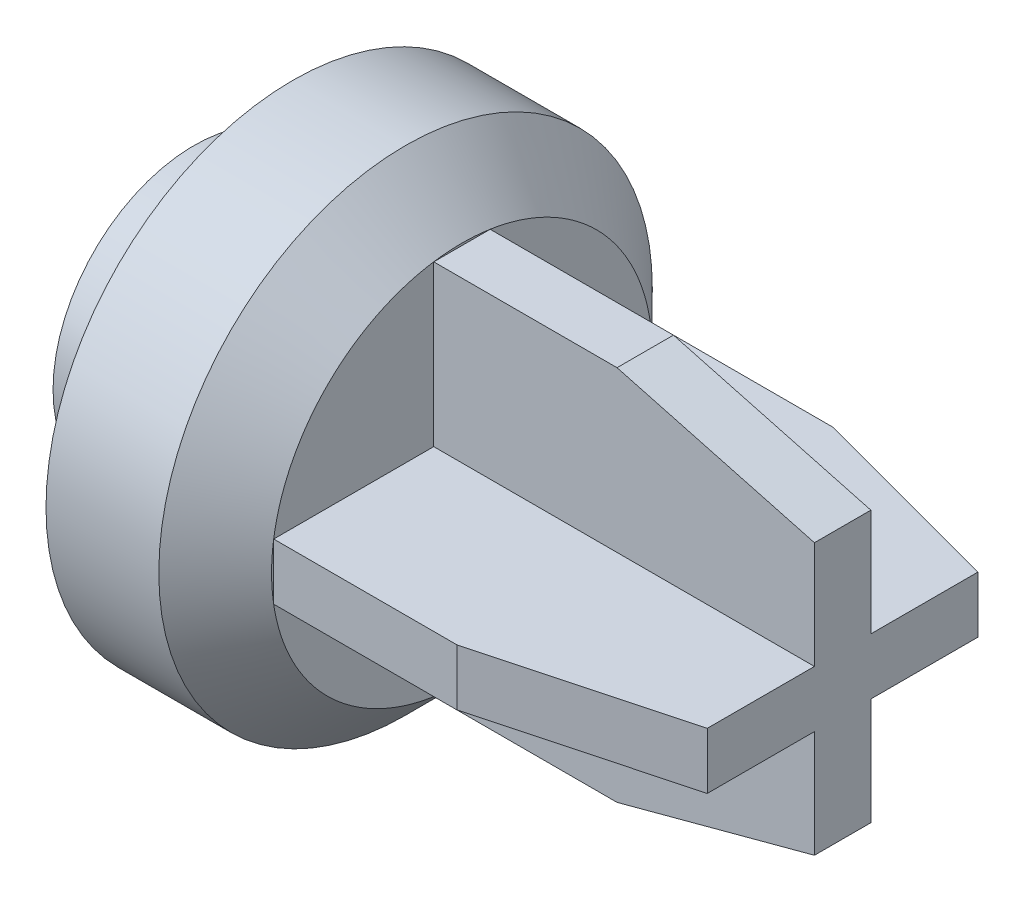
ISO-10303-21;
HEADER;
FILE_DESCRIPTION(('STEP AP214'),'2;1');
FILE_NAME('part.step','',(''),(''),'','','');
FILE_SCHEMA(('AUTOMOTIVE_DESIGN { 1 0 10303 214 1 1 1 1 }'));
ENDSEC;
DATA;
#1=APPLICATION_CONTEXT('core data for automotive mechanical design processes');
#2=APPLICATION_PROTOCOL_DEFINITION('international standard','automotive_design',2000,#1);
#3=PRODUCT_CONTEXT('',#1,'mechanical');
#4=PRODUCT('Part','Part','',(#3));
#5=PRODUCT_RELATED_PRODUCT_CATEGORY('part','',(#4));
#6=PRODUCT_DEFINITION_FORMATION('','',#4);
#7=PRODUCT_DEFINITION_CONTEXT('part definition',#1,'design');
#8=PRODUCT_DEFINITION('design','',#6,#7);
#9=PRODUCT_DEFINITION_SHAPE('','',#8);
#10=(LENGTH_UNIT() NAMED_UNIT(*) SI_UNIT(.MILLI.,.METRE.));
#11=(NAMED_UNIT(*) PLANE_ANGLE_UNIT() SI_UNIT($,.RADIAN.));
#12=(NAMED_UNIT(*) SI_UNIT($,.STERADIAN.) SOLID_ANGLE_UNIT());
#13=UNCERTAINTY_MEASURE_WITH_UNIT(LENGTH_MEASURE(1.E-05),#10,'distance_accuracy_value','');
#14=(GEOMETRIC_REPRESENTATION_CONTEXT(3) GLOBAL_UNCERTAINTY_ASSIGNED_CONTEXT((#13)) GLOBAL_UNIT_ASSIGNED_CONTEXT((#10,
#11,#12)) REPRESENTATION_CONTEXT('',''));
#15=CARTESIAN_POINT('',(0.,0.,0.));
#16=DIRECTION('',(0.,0.,1.));
#17=DIRECTION('',(1.,0.,0.));
#18=AXIS2_PLACEMENT_3D('',#15,#16,#17);
#19=CARTESIAN_POINT('',(2.5,-6.675,1.));
#20=DIRECTION('',(0.,0.,1.));
#21=DIRECTION('',(1.,0.,0.));
#22=AXIS2_PLACEMENT_3D('',#19,#20,#21);
#23=PLANE('',#22);
#24=DIRECTION('',(0.,1.,0.));
#25=VECTOR('',#24,1.);
#26=CARTESIAN_POINT('',(16.,4.8,1.));
#27=LINE('',#26,#25);
#28=CARTESIAN_POINT('',(16.,-4.8,1.));
#29=VERTEX_POINT('',#28);
#30=CARTESIAN_POINT('',(16.,-0.999999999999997,1.));
#31=VERTEX_POINT('',#30);
#32=EDGE_CURVE('E187',#29,#31,#27,.T.);
#33=ORIENTED_EDGE('',*,*,#32,.T.);
#34=DIRECTION('',(-1.,0.,0.));
#35=VECTOR('',#34,1.);
#36=CARTESIAN_POINT('',(2.5,-0.999999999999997,1.));
#37=LINE('',#36,#35);
#38=CARTESIAN_POINT('',(2.5,-0.999999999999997,1.));
#39=VERTEX_POINT('',#38);
#40=EDGE_CURVE('E169',#31,#39,#37,.T.);
#41=ORIENTED_EDGE('',*,*,#40,.T.);
#42=DIRECTION('',(0.,-1.,0.));
#43=VECTOR('',#42,1.);
#44=CARTESIAN_POINT('',(2.5,6.675,1.));
#45=LINE('',#44,#43);
#46=CARTESIAN_POINT('',(2.5,-6.675,1.));
#47=VERTEX_POINT('',#46);
#48=EDGE_CURVE('E182',#39,#47,#45,.T.);
#49=ORIENTED_EDGE('',*,*,#48,.T.);
#50=DIRECTION('',(1.,0.,0.));
#51=VECTOR('',#50,1.);
#52=CARTESIAN_POINT('',(2.5,-6.675,1.));
#53=LINE('',#52,#51);
#54=CARTESIAN_POINT('',(9.00000000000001,-6.675,1.));
#55=VERTEX_POINT('',#54);
#56=EDGE_CURVE('E181',#47,#55,#53,.T.);
#57=ORIENTED_EDGE('',*,*,#56,.T.);
#58=DIRECTION('',(0.965948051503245,0.258736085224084,0.));
#59=VECTOR('',#58,1.);
#60=CARTESIAN_POINT('',(16.,-4.8,1.));
#61=LINE('',#60,#59);
#62=EDGE_CURVE('E184',#55,#29,#61,.T.);
#63=ORIENTED_EDGE('',*,*,#62,.T.);
#64=EDGE_LOOP('',(#33,#41,#49,#57,#63));
#65=FACE_BOUND('',#64,.T.);
#66=ADVANCED_FACE('F32',(#65),#23,.T.);
#67=CARTESIAN_POINT('',(2.5,-6.675,-1.));
#68=DIRECTION('',(0.,0.,1.));
#69=DIRECTION('',(1.,0.,0.));
#70=AXIS2_PLACEMENT_3D('',#67,#68,#69);
#71=PLANE('',#70);
#72=DIRECTION('',(-1.,0.,0.));
#73=VECTOR('',#72,1.);
#74=CARTESIAN_POINT('',(2.5,-1.,-1.));
#75=LINE('',#74,#73);
#76=CARTESIAN_POINT('',(16.,-1.,-1.));
#77=VERTEX_POINT('',#76);
#78=CARTESIAN_POINT('',(2.5,-1.,-1.));
#79=VERTEX_POINT('',#78);
#80=EDGE_CURVE('E40',#77,#79,#75,.T.);
#81=ORIENTED_EDGE('',*,*,#80,.F.);
#82=DIRECTION('',(0.,1.,0.));
#83=VECTOR('',#82,1.);
#84=CARTESIAN_POINT('',(16.,4.8,-1.));
#85=LINE('',#84,#83);
#86=CARTESIAN_POINT('',(16.,-4.8,-1.));
#87=VERTEX_POINT('',#86);
#88=EDGE_CURVE('E203',#87,#77,#85,.T.);
#89=ORIENTED_EDGE('',*,*,#88,.F.);
#90=DIRECTION('',(0.965948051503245,0.258736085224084,0.));
#91=VECTOR('',#90,1.);
#92=CARTESIAN_POINT('',(16.,-4.8,-1.));
#93=LINE('',#92,#91);
#94=CARTESIAN_POINT('',(9.00000000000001,-6.675,-1.));
#95=VERTEX_POINT('',#94);
#96=EDGE_CURVE('E200',#95,#87,#93,.T.);
#97=ORIENTED_EDGE('',*,*,#96,.F.);
#98=DIRECTION('',(1.,0.,0.));
#99=VECTOR('',#98,1.);
#100=CARTESIAN_POINT('',(2.5,-6.675,-1.));
#101=LINE('',#100,#99);
#102=CARTESIAN_POINT('',(2.5,-6.675,-1.));
#103=VERTEX_POINT('',#102);
#104=EDGE_CURVE('E198',#103,#95,#101,.T.);
#105=ORIENTED_EDGE('',*,*,#104,.F.);
#106=DIRECTION('',(0.,-1.,0.));
#107=VECTOR('',#106,1.);
#108=CARTESIAN_POINT('',(2.5,6.675,-1.));
#109=LINE('',#108,#107);
#110=EDGE_CURVE('E178',#79,#103,#109,.T.);
#111=ORIENTED_EDGE('',*,*,#110,.F.);
#112=EDGE_LOOP('',(#81,#89,#97,#105,#111));
#113=FACE_BOUND('',#112,.T.);
#114=ADVANCED_FACE('F264',(#113),#71,.F.);
#115=CARTESIAN_POINT('',(0.,3.875,0.));
#116=DIRECTION('',(1.,0.,0.));
#117=DIRECTION('',(0.,0.,-1.));
#118=AXIS2_PLACEMENT_3D('',#115,#116,#117);
#119=PLANE('',#118);
#120=CARTESIAN_POINT('',(0.,0.,0.));
#121=DIRECTION('',(-1.,0.,0.));
#122=DIRECTION('',(0.,0.,1.));
#123=AXIS2_PLACEMENT_3D('',#120,#121,#122);
#124=CIRCLE('',#123,3.875);
#125=CARTESIAN_POINT('',(0.,0.,3.875));
#126=VERTEX_POINT('',#125);
#127=EDGE_CURVE('E251',#126,#126,#124,.T.);
#128=ORIENTED_EDGE('',*,*,#127,.T.);
#129=EDGE_LOOP('',(#128));
#130=FACE_BOUND('',#129,.T.);
#131=ADVANCED_FACE('F34',(#130),#119,.F.);
#132=CARTESIAN_POINT('',(-7.,0.,0.));
#133=DIRECTION('',(1.,0.,0.));
#134=DIRECTION('',(0.,0.,-1.));
#135=AXIS2_PLACEMENT_3D('',#132,#133,#134);
#136=CONICAL_SURFACE('',#135,3.5,0.0535202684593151);
#137=ORIENTED_EDGE('',*,*,#127,.F.);
#138=EDGE_LOOP('',(#137));
#139=FACE_BOUND('',#138,.T.);
#140=CARTESIAN_POINT('',(-7.,0.,0.));
#141=DIRECTION('',(-1.,0.,0.));
#142=DIRECTION('',(0.,0.,1.));
#143=AXIS2_PLACEMENT_3D('',#140,#141,#142);
#144=CIRCLE('',#143,3.5);
#145=CARTESIAN_POINT('',(-7.,0.,3.5));
#146=VERTEX_POINT('',#145);
#147=EDGE_CURVE('E248',#146,#146,#144,.T.);
#148=ORIENTED_EDGE('',*,*,#147,.T.);
#149=EDGE_LOOP('',(#148));
#150=FACE_BOUND('',#149,.T.);
#151=ADVANCED_FACE('F544',(#139,#150),#136,.F.);
#152=CARTESIAN_POINT('',(-7.,5.,0.));
#153=DIRECTION('',(1.,0.,0.));
#154=DIRECTION('',(0.,0.,-1.));
#155=AXIS2_PLACEMENT_3D('',#152,#153,#154);
#156=PLANE('',#155);
#157=ORIENTED_EDGE('',*,*,#147,.F.);
#158=EDGE_LOOP('',(#157));
#159=FACE_BOUND('',#158,.T.);
#160=CARTESIAN_POINT('',(-7.,0.,0.));
#161=DIRECTION('',(-1.,0.,0.));
#162=DIRECTION('',(0.,0.,1.));
#163=AXIS2_PLACEMENT_3D('',#160,#161,#162);
#164=CIRCLE('',#163,5.);
#165=CARTESIAN_POINT('',(-7.,0.,5.));
#166=VERTEX_POINT('',#165);
#167=EDGE_CURVE('E245',#166,#166,#164,.T.);
#168=ORIENTED_EDGE('',*,*,#167,.T.);
#169=EDGE_LOOP('',(#168));
#170=FACE_BOUND('',#169,.T.);
#171=ADVANCED_FACE('F534',(#159,#170),#156,.F.);
#172=CARTESIAN_POINT('',(-0.5,0.,0.));
#173=DIRECTION('',(1.,0.,0.));
#174=DIRECTION('',(0.,0.,-1.));
#175=AXIS2_PLACEMENT_3D('',#172,#173,#174);
#176=CONICAL_SURFACE('',#175,5.34,0.0522600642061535);
#177=ORIENTED_EDGE('',*,*,#167,.F.);
#178=EDGE_LOOP('',(#177));
#179=FACE_BOUND('',#178,.T.);
#180=CARTESIAN_POINT('',(-0.5,0.,0.));
#181=DIRECTION('',(-1.,0.,0.));
#182=DIRECTION('',(0.,0.,1.));
#183=AXIS2_PLACEMENT_3D('',#180,#181,#182);
#184=CIRCLE('',#183,5.34);
#185=CARTESIAN_POINT('',(-0.5,0.,5.34));
#186=VERTEX_POINT('',#185);
#187=EDGE_CURVE('E242',#186,#186,#184,.T.);
#188=ORIENTED_EDGE('',*,*,#187,.T.);
#189=EDGE_LOOP('',(#188));
#190=FACE_BOUND('',#189,.T.);
#191=ADVANCED_FACE('F524',(#179,#190),#176,.T.);
#192=CARTESIAN_POINT('',(-0.5,6.75,0.));
#193=DIRECTION('',(1.,0.,0.));
#194=DIRECTION('',(0.,0.,-1.));
#195=AXIS2_PLACEMENT_3D('',#192,#193,#194);
#196=PLANE('',#195);
#197=ORIENTED_EDGE('',*,*,#187,.F.);
#198=EDGE_LOOP('',(#197));
#199=FACE_BOUND('',#198,.T.);
#200=CARTESIAN_POINT('',(-0.5,0.,0.));
#201=DIRECTION('',(-1.,0.,0.));
#202=DIRECTION('',(0.,0.,1.));
#203=AXIS2_PLACEMENT_3D('',#200,#201,#202);
#204=CIRCLE('',#203,6.75);
#205=CARTESIAN_POINT('',(-0.5,0.,6.75));
#206=VERTEX_POINT('',#205);
#207=EDGE_CURVE('E239',#206,#206,#204,.T.);
#208=ORIENTED_EDGE('',*,*,#207,.T.);
#209=EDGE_LOOP('',(#208));
#210=FACE_BOUND('',#209,.T.);
#211=ADVANCED_FACE('F514',(#199,#210),#196,.F.);
#212=CARTESIAN_POINT('',(0.,0.,0.));
#213=DIRECTION('',(-1.,0.,0.));
#214=DIRECTION('',(0.,0.,1.));
#215=AXIS2_PLACEMENT_3D('',#212,#213,#214);
#216=CYLINDRICAL_SURFACE('',#215,6.75);
#217=ORIENTED_EDGE('',*,*,#207,.F.);
#218=EDGE_LOOP('',(#217));
#219=FACE_BOUND('',#218,.T.);
#220=CARTESIAN_POINT('',(-3.5,0.,0.));
#221=DIRECTION('',(-1.,0.,0.));
#222=DIRECTION('',(0.,0.,1.));
#223=AXIS2_PLACEMENT_3D('',#220,#221,#222);
#224=CIRCLE('',#223,6.75);
#225=CARTESIAN_POINT('',(-3.5,0.,6.75));
#226=VERTEX_POINT('',#225);
#227=EDGE_CURVE('E236',#226,#226,#224,.T.);
#228=ORIENTED_EDGE('',*,*,#227,.T.);
#229=EDGE_LOOP('',(#228));
#230=FACE_BOUND('',#229,.T.);
#231=ADVANCED_FACE('F504',(#219,#230),#216,.F.);
#232=CARTESIAN_POINT('',(-3.5,8.75,0.));
#233=DIRECTION('',(1.,0.,0.));
#234=DIRECTION('',(0.,0.,-1.));
#235=AXIS2_PLACEMENT_3D('',#232,#233,#234);
#236=PLANE('',#235);
#237=ORIENTED_EDGE('',*,*,#227,.F.);
#238=EDGE_LOOP('',(#237));
#239=FACE_BOUND('',#238,.T.);
#240=CARTESIAN_POINT('',(-3.5,0.,0.));
#241=DIRECTION('',(-1.,0.,0.));
#242=DIRECTION('',(0.,0.,1.));
#243=AXIS2_PLACEMENT_3D('',#240,#241,#242);
#244=CIRCLE('',#243,8.75);
#245=CARTESIAN_POINT('',(-3.5,0.,8.75));
#246=VERTEX_POINT('',#245);
#247=EDGE_CURVE('E233',#246,#246,#244,.T.);
#248=ORIENTED_EDGE('',*,*,#247,.T.);
#249=EDGE_LOOP('',(#248));
#250=FACE_BOUND('',#249,.T.);
#251=ADVANCED_FACE('F494',(#239,#250),#236,.F.);
#252=CARTESIAN_POINT('',(0.,0.,0.));
#253=DIRECTION('',(-1.,0.,0.));
#254=DIRECTION('',(0.,0.,1.));
#255=AXIS2_PLACEMENT_3D('',#252,#253,#254);
#256=CYLINDRICAL_SURFACE('',#255,8.75);
#257=ORIENTED_EDGE('',*,*,#247,.F.);
#258=EDGE_LOOP('',(#257));
#259=FACE_BOUND('',#258,.T.);
#260=CARTESIAN_POINT('',(0.5,0.,0.));
#261=DIRECTION('',(-1.,0.,0.));
#262=DIRECTION('',(0.,0.,1.));
#263=AXIS2_PLACEMENT_3D('',#260,#261,#262);
#264=CIRCLE('',#263,8.75);
#265=CARTESIAN_POINT('',(0.5,0.,8.75));
#266=VERTEX_POINT('',#265);
#267=EDGE_CURVE('E230',#266,#266,#264,.T.);
#268=ORIENTED_EDGE('',*,*,#267,.T.);
#269=EDGE_LOOP('',(#268));
#270=FACE_BOUND('',#269,.T.);
#271=ADVANCED_FACE('F484',(#259,#270),#256,.T.);
#272=CARTESIAN_POINT('',(2.5,0.,0.));
#273=DIRECTION('',(-1.,0.,0.));
#274=DIRECTION('',(0.,0.,1.));
#275=AXIS2_PLACEMENT_3D('',#272,#273,#274);
#276=CONICAL_SURFACE('',#275,6.74999999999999,0.78539816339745);
#277=ORIENTED_EDGE('',*,*,#267,.F.);
#278=EDGE_LOOP('',(#277));
#279=FACE_BOUND('',#278,.T.);
#280=CARTESIAN_POINT('',(2.5,0.,0.));
#281=DIRECTION('',(-1.,0.,0.));
#282=DIRECTION('',(0.,0.,1.));
#283=AXIS2_PLACEMENT_3D('',#280,#281,#282);
#284=CIRCLE('',#283,6.74999999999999);
#285=CARTESIAN_POINT('',(2.5,0.,6.74999999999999));
#286=VERTEX_POINT('',#285);
#287=EDGE_CURVE('E227',#286,#286,#284,.T.);
#288=ORIENTED_EDGE('',*,*,#287,.T.);
#289=EDGE_LOOP('',(#288));
#290=FACE_BOUND('',#289,.T.);
#291=ADVANCED_FACE('F479',(#279,#290),#276,.T.);
#292=CARTESIAN_POINT('',(2.5,6.74999999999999,0.));
#293=DIRECTION('',(-1.,0.,0.));
#294=DIRECTION('',(0.,0.,1.));
#295=AXIS2_PLACEMENT_3D('',#292,#293,#294);
#296=PLANE('',#295);
#297=DIRECTION('',(0.,-1.,0.));
#298=VECTOR('',#297,1.);
#299=CARTESIAN_POINT('',(2.5,1.00000000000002,6.675));
#300=LINE('',#299,#298);
#301=CARTESIAN_POINT('',(2.5,1.00000000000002,6.675));
#302=VERTEX_POINT('',#301);
#303=CARTESIAN_POINT('',(2.5,-0.999999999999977,6.675));
#304=VERTEX_POINT('',#303);
#305=EDGE_CURVE('E158',#302,#304,#300,.T.);
#306=ORIENTED_EDGE('',*,*,#305,.F.);
#307=DIRECTION('',(0.,0.,1.));
#308=VECTOR('',#307,1.);
#309=CARTESIAN_POINT('',(2.5,0.999999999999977,-6.675));
#310=LINE('',#309,#308);
#311=CARTESIAN_POINT('',(2.5,1.,1.));
#312=VERTEX_POINT('',#311);
#313=EDGE_CURVE('E144',#312,#302,#310,.T.);
#314=ORIENTED_EDGE('',*,*,#313,.F.);
#315=CARTESIAN_POINT('',(2.5,6.675,1.));
#316=VERTEX_POINT('',#315);
#317=EDGE_CURVE('E179',#316,#312,#45,.T.);
#318=ORIENTED_EDGE('',*,*,#317,.F.);
#319=DIRECTION('',(0.,0.,-1.));
#320=VECTOR('',#319,1.);
#321=CARTESIAN_POINT('',(2.5,6.675,1.));
#322=LINE('',#321,#320);
#323=CARTESIAN_POINT('',(2.5,6.675,-1.));
#324=VERTEX_POINT('',#323);
#325=EDGE_CURVE('E195',#316,#324,#322,.T.);
#326=ORIENTED_EDGE('',*,*,#325,.T.);
#327=CARTESIAN_POINT('',(2.5,0.999999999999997,-1.));
#328=VERTEX_POINT('',#327);
#329=EDGE_CURVE('E196',#324,#328,#109,.T.);
#330=ORIENTED_EDGE('',*,*,#329,.T.);
#331=CARTESIAN_POINT('',(2.5,0.999999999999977,-6.675));
#332=VERTEX_POINT('',#331);
#333=EDGE_CURVE('E47',#332,#328,#310,.T.);
#334=ORIENTED_EDGE('',*,*,#333,.F.);
#335=DIRECTION('',(0.,-1.,0.));
#336=VECTOR('',#335,1.);
#337=CARTESIAN_POINT('',(2.5,0.999999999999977,-6.675));
#338=LINE('',#337,#336);
#339=CARTESIAN_POINT('',(2.5,-1.00000000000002,-6.675));
#340=VERTEX_POINT('',#339);
#341=EDGE_CURVE('E52',#332,#340,#338,.T.);
#342=ORIENTED_EDGE('',*,*,#341,.T.);
#343=DIRECTION('',(0.,0.,1.));
#344=VECTOR('',#343,1.);
#345=CARTESIAN_POINT('',(2.5,-1.00000000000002,-6.675));
#346=LINE('',#345,#344);
#347=EDGE_CURVE('E259',#340,#79,#346,.T.);
#348=ORIENTED_EDGE('',*,*,#347,.T.);
#349=ORIENTED_EDGE('',*,*,#110,.T.);
#350=DIRECTION('',(0.,0.,-1.));
#351=VECTOR('',#350,1.);
#352=CARTESIAN_POINT('',(2.5,-6.675,1.));
#353=LINE('',#352,#351);
#354=EDGE_CURVE('E224',#47,#103,#353,.T.);
#355=ORIENTED_EDGE('',*,*,#354,.F.);
#356=ORIENTED_EDGE('',*,*,#48,.F.);
#357=EDGE_CURVE('E168',#39,#304,#346,.T.);
#358=ORIENTED_EDGE('',*,*,#357,.T.);
#359=EDGE_LOOP('',(#306,#314,#318,#326,#330,#334,#342,#348,#349,#355,#356,#358));
#360=FACE_BOUND('',#359,.T.);
#361=ORIENTED_EDGE('',*,*,#287,.F.);
#362=EDGE_LOOP('',(#361));
#363=FACE_BOUND('',#362,.T.);
#364=ADVANCED_FACE('F165',(#360,#363),#296,.F.);
#365=CARTESIAN_POINT('',(2.5,-6.675,1.));
#366=DIRECTION('',(0.,1.,0.));
#367=DIRECTION('',(0.,0.,1.));
#368=AXIS2_PLACEMENT_3D('',#365,#366,#367);
#369=PLANE('',#368);
#370=ORIENTED_EDGE('',*,*,#104,.T.);
#371=DIRECTION('',(0.,0.,-1.));
#372=VECTOR('',#371,1.);
#373=CARTESIAN_POINT('',(9.00000000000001,-6.675,1.));
#374=LINE('',#373,#372);
#375=EDGE_CURVE('E221',#55,#95,#374,.T.);
#376=ORIENTED_EDGE('',*,*,#375,.F.);
#377=ORIENTED_EDGE('',*,*,#56,.F.);
#378=ORIENTED_EDGE('',*,*,#354,.T.);
#379=EDGE_LOOP('',(#370,#376,#377,#378));
#380=FACE_BOUND('',#379,.T.);
#381=ADVANCED_FACE('F282',(#380),#369,.F.);
#382=CARTESIAN_POINT('',(16.,-4.8,1.));
#383=DIRECTION('',(-0.258736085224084,0.965948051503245,0.));
#384=DIRECTION('',(-0.965948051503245,-0.258736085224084,0.));
#385=AXIS2_PLACEMENT_3D('',#382,#383,#384);
#386=PLANE('',#385);
#387=ORIENTED_EDGE('',*,*,#96,.T.);
#388=DIRECTION('',(0.,0.,-1.));
#389=VECTOR('',#388,1.);
#390=CARTESIAN_POINT('',(16.,-4.8,1.));
#391=LINE('',#390,#389);
#392=EDGE_CURVE('E218',#29,#87,#391,.T.);
#393=ORIENTED_EDGE('',*,*,#392,.F.);
#394=ORIENTED_EDGE('',*,*,#62,.F.);
#395=ORIENTED_EDGE('',*,*,#375,.T.);
#396=EDGE_LOOP('',(#387,#393,#394,#395));
#397=FACE_BOUND('',#396,.T.);
#398=ADVANCED_FACE('F277',(#397),#386,.F.);
#399=CARTESIAN_POINT('',(16.,4.8,1.));
#400=DIRECTION('',(-1.,0.,0.));
#401=DIRECTION('',(0.,-1.,0.));
#402=AXIS2_PLACEMENT_3D('',#399,#400,#401);
#403=PLANE('',#402);
#404=CARTESIAN_POINT('',(16.,1.,1.));
#405=VERTEX_POINT('',#404);
#406=CARTESIAN_POINT('',(16.,4.8,1.));
#407=VERTEX_POINT('',#406);
#408=EDGE_CURVE('E186',#405,#407,#27,.T.);
#409=ORIENTED_EDGE('',*,*,#408,.F.);
#410=DIRECTION('',(0.,0.,-1.));
#411=VECTOR('',#410,1.);
#412=CARTESIAN_POINT('',(16.,0.999999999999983,-4.8));
#413=LINE('',#412,#411);
#414=CARTESIAN_POINT('',(16.,1.00000000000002,4.8));
#415=VERTEX_POINT('',#414);
#416=EDGE_CURVE('E306',#415,#405,#413,.T.);
#417=ORIENTED_EDGE('',*,*,#416,.F.);
#418=DIRECTION('',(0.,-1.,0.));
#419=VECTOR('',#418,1.);
#420=CARTESIAN_POINT('',(16.,1.00000000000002,4.8));
#421=LINE('',#420,#419);
#422=CARTESIAN_POINT('',(16.,-0.999999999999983,4.8));
#423=VERTEX_POINT('',#422);
#424=EDGE_CURVE('E173',#415,#423,#421,.T.);
#425=ORIENTED_EDGE('',*,*,#424,.T.);
#426=DIRECTION('',(0.,0.,-1.));
#427=VECTOR('',#426,1.);
#428=CARTESIAN_POINT('',(16.,-1.00000000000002,-4.8));
#429=LINE('',#428,#427);
#430=EDGE_CURVE('E292',#423,#31,#429,.T.);
#431=ORIENTED_EDGE('',*,*,#430,.T.);
#432=ORIENTED_EDGE('',*,*,#32,.F.);
#433=ORIENTED_EDGE('',*,*,#392,.T.);
#434=ORIENTED_EDGE('',*,*,#88,.T.);
#435=CARTESIAN_POINT('',(16.,-1.00000000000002,-4.8));
#436=VERTEX_POINT('',#435);
#437=EDGE_CURVE('E261',#77,#436,#429,.T.);
#438=ORIENTED_EDGE('',*,*,#437,.T.);
#439=DIRECTION('',(0.,-1.,0.));
#440=VECTOR('',#439,1.);
#441=CARTESIAN_POINT('',(16.,0.999999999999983,-4.8));
#442=LINE('',#441,#440);
#443=CARTESIAN_POINT('',(16.,0.999999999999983,-4.8));
#444=VERTEX_POINT('',#443);
#445=EDGE_CURVE('E301',#444,#436,#442,.T.);
#446=ORIENTED_EDGE('',*,*,#445,.F.);
#447=CARTESIAN_POINT('',(16.,0.999999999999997,-1.));
#448=VERTEX_POINT('',#447);
#449=EDGE_CURVE('E349',#448,#444,#413,.T.);
#450=ORIENTED_EDGE('',*,*,#449,.F.);
#451=CARTESIAN_POINT('',(16.,4.8,-1.));
#452=VERTEX_POINT('',#451);
#453=EDGE_CURVE('E202',#448,#452,#85,.T.);
#454=ORIENTED_EDGE('',*,*,#453,.T.);
#455=DIRECTION('',(0.,0.,-1.));
#456=VECTOR('',#455,1.);
#457=CARTESIAN_POINT('',(16.,4.8,1.));
#458=LINE('',#457,#456);
#459=EDGE_CURVE('E215',#407,#452,#458,.T.);
#460=ORIENTED_EDGE('',*,*,#459,.F.);
#461=EDGE_LOOP('',(#409,#417,#425,#431,#432,#433,#434,#438,#446,#450,#454,#460));
#462=FACE_BOUND('',#461,.T.);
#463=ADVANCED_FACE('F269',(#462),#403,.F.);
#464=CARTESIAN_POINT('',(9.,6.675,1.));
#465=DIRECTION('',(-0.258736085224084,-0.965948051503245,0.));
#466=DIRECTION('',(0.965948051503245,-0.258736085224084,0.));
#467=AXIS2_PLACEMENT_3D('',#464,#465,#466);
#468=PLANE('',#467);
#469=DIRECTION('',(-0.965948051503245,0.258736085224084,0.));
#470=VECTOR('',#469,1.);
#471=CARTESIAN_POINT('',(9.,6.675,-1.));
#472=LINE('',#471,#470);
#473=CARTESIAN_POINT('',(9.,6.675,-1.));
#474=VERTEX_POINT('',#473);
#475=EDGE_CURVE('E206',#452,#474,#472,.T.);
#476=ORIENTED_EDGE('',*,*,#475,.T.);
#477=DIRECTION('',(0.,0.,-1.));
#478=VECTOR('',#477,1.);
#479=CARTESIAN_POINT('',(9.,6.675,1.));
#480=LINE('',#479,#478);
#481=CARTESIAN_POINT('',(9.,6.675,1.));
#482=VERTEX_POINT('',#481);
#483=EDGE_CURVE('E212',#482,#474,#480,.T.);
#484=ORIENTED_EDGE('',*,*,#483,.F.);
#485=DIRECTION('',(-0.965948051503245,0.258736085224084,0.));
#486=VECTOR('',#485,1.);
#487=CARTESIAN_POINT('',(9.,6.675,1.));
#488=LINE('',#487,#486);
#489=EDGE_CURVE('E190',#407,#482,#488,.T.);
#490=ORIENTED_EDGE('',*,*,#489,.F.);
#491=ORIENTED_EDGE('',*,*,#459,.T.);
#492=EDGE_LOOP('',(#476,#484,#490,#491));
#493=FACE_BOUND('',#492,.T.);
#494=ADVANCED_FACE('F330',(#493),#468,.F.);
#495=CARTESIAN_POINT('',(2.5,6.675,1.));
#496=DIRECTION('',(0.,-1.,0.));
#497=DIRECTION('',(0.,0.,-1.));
#498=AXIS2_PLACEMENT_3D('',#495,#496,#497);
#499=PLANE('',#498);
#500=DIRECTION('',(-1.,0.,0.));
#501=VECTOR('',#500,1.);
#502=CARTESIAN_POINT('',(2.5,6.675,-1.));
#503=LINE('',#502,#501);
#504=EDGE_CURVE('E208',#474,#324,#503,.T.);
#505=ORIENTED_EDGE('',*,*,#504,.T.);
#506=ORIENTED_EDGE('',*,*,#325,.F.);
#507=DIRECTION('',(-1.,0.,0.));
#508=VECTOR('',#507,1.);
#509=CARTESIAN_POINT('',(2.5,6.675,1.));
#510=LINE('',#509,#508);
#511=EDGE_CURVE('E192',#482,#316,#510,.T.);
#512=ORIENTED_EDGE('',*,*,#511,.F.);
#513=ORIENTED_EDGE('',*,*,#483,.T.);
#514=EDGE_LOOP('',(#505,#506,#512,#513));
#515=FACE_BOUND('',#514,.T.);
#516=ADVANCED_FACE('F322',(#515),#499,.F.);
#517=DIRECTION('',(-1.,0.,0.));
#518=VECTOR('',#517,1.);
#519=CARTESIAN_POINT('',(2.5,1.,1.));
#520=LINE('',#519,#518);
#521=EDGE_CURVE('E150',#405,#312,#520,.T.);
#522=ORIENTED_EDGE('',*,*,#521,.F.);
#523=ORIENTED_EDGE('',*,*,#408,.T.);
#524=ORIENTED_EDGE('',*,*,#489,.T.);
#525=ORIENTED_EDGE('',*,*,#511,.T.);
#526=ORIENTED_EDGE('',*,*,#317,.T.);
#527=EDGE_LOOP('',(#522,#523,#524,#525,#526));
#528=FACE_BOUND('',#527,.T.);
#529=ADVANCED_FACE('F314',(#528),#23,.T.);
#530=ORIENTED_EDGE('',*,*,#453,.F.);
#531=DIRECTION('',(-1.,0.,0.));
#532=VECTOR('',#531,1.);
#533=CARTESIAN_POINT('',(2.5,0.999999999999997,-1.));
#534=LINE('',#533,#532);
#535=EDGE_CURVE('E11',#448,#328,#534,.T.);
#536=ORIENTED_EDGE('',*,*,#535,.T.);
#537=ORIENTED_EDGE('',*,*,#329,.F.);
#538=ORIENTED_EDGE('',*,*,#504,.F.);
#539=ORIENTED_EDGE('',*,*,#475,.F.);
#540=EDGE_LOOP('',(#530,#536,#537,#538,#539));
#541=FACE_BOUND('',#540,.T.);
#542=ADVANCED_FACE('F319',(#541),#71,.F.);
#543=CARTESIAN_POINT('',(9.,0.999999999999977,-6.675));
#544=DIRECTION('',(-0.258736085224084,0.,0.965948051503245));
#545=DIRECTION('',(0.965948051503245,0.,0.258736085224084));
#546=AXIS2_PLACEMENT_3D('',#543,#544,#545);
#547=PLANE('',#546);
#548=DIRECTION('',(-0.965948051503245,0.,-0.258736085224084));
#549=VECTOR('',#548,1.);
#550=CARTESIAN_POINT('',(9.,-1.00000000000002,-6.675));
#551=LINE('',#550,#549);
#552=CARTESIAN_POINT('',(9.,-1.00000000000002,-6.675));
#553=VERTEX_POINT('',#552);
#554=EDGE_CURVE('E294',#436,#553,#551,.T.);
#555=ORIENTED_EDGE('',*,*,#554,.T.);
#556=DIRECTION('',(0.,-1.,0.));
#557=VECTOR('',#556,1.);
#558=CARTESIAN_POINT('',(9.,0.999999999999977,-6.675));
#559=LINE('',#558,#557);
#560=CARTESIAN_POINT('',(9.,0.999999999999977,-6.675));
#561=VERTEX_POINT('',#560);
#562=EDGE_CURVE('E298',#561,#553,#559,.T.);
#563=ORIENTED_EDGE('',*,*,#562,.F.);
#564=DIRECTION('',(-0.965948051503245,0.,-0.258736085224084));
#565=VECTOR('',#564,1.);
#566=CARTESIAN_POINT('',(9.,0.999999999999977,-6.675));
#567=LINE('',#566,#565);
#568=EDGE_CURVE('E350',#444,#561,#567,.T.);
#569=ORIENTED_EDGE('',*,*,#568,.F.);
#570=ORIENTED_EDGE('',*,*,#445,.T.);
#571=EDGE_LOOP('',(#555,#563,#569,#570));
#572=FACE_BOUND('',#571,.T.);
#573=ADVANCED_FACE('F328',(#572),#547,.F.);
#574=CARTESIAN_POINT('',(2.5,-0.999999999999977,6.675));
#575=DIRECTION('',(0.,1.,0.));
#576=DIRECTION('',(1.,0.,0.));
#577=AXIS2_PLACEMENT_3D('',#574,#575,#576);
#578=PLANE('',#577);
#579=ORIENTED_EDGE('',*,*,#437,.F.);
#580=ORIENTED_EDGE('',*,*,#80,.T.);
#581=ORIENTED_EDGE('',*,*,#347,.F.);
#582=DIRECTION('',(-1.,0.,0.));
#583=VECTOR('',#582,1.);
#584=CARTESIAN_POINT('',(2.5,-1.00000000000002,-6.675));
#585=LINE('',#584,#583);
#586=EDGE_CURVE('E153',#553,#340,#585,.T.);
#587=ORIENTED_EDGE('',*,*,#586,.F.);
#588=ORIENTED_EDGE('',*,*,#554,.F.);
#589=EDGE_LOOP('',(#579,#580,#581,#587,#588));
#590=FACE_BOUND('',#589,.T.);
#591=ADVANCED_FACE('F257',(#590),#578,.F.);
#592=CARTESIAN_POINT('',(2.5,1.00000000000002,6.675));
#593=DIRECTION('',(0.,1.,0.));
#594=DIRECTION('',(1.,0.,0.));
#595=AXIS2_PLACEMENT_3D('',#592,#593,#594);
#596=PLANE('',#595);
#597=ORIENTED_EDGE('',*,*,#535,.F.);
#598=ORIENTED_EDGE('',*,*,#449,.T.);
#599=ORIENTED_EDGE('',*,*,#568,.T.);
#600=DIRECTION('',(-1.,0.,0.));
#601=VECTOR('',#600,1.);
#602=CARTESIAN_POINT('',(2.5,0.999999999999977,-6.675));
#603=LINE('',#602,#601);
#604=EDGE_CURVE('E288',#561,#332,#603,.T.);
#605=ORIENTED_EDGE('',*,*,#604,.T.);
#606=ORIENTED_EDGE('',*,*,#333,.T.);
#607=EDGE_LOOP('',(#597,#598,#599,#605,#606));
#608=FACE_BOUND('',#607,.T.);
#609=ADVANCED_FACE('F345',(#608),#596,.T.);
#610=CARTESIAN_POINT('',(2.5,0.999999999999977,-6.675));
#611=DIRECTION('',(0.,0.,1.));
#612=DIRECTION('',(0.,-1.,0.));
#613=AXIS2_PLACEMENT_3D('',#610,#611,#612);
#614=PLANE('',#613);
#615=ORIENTED_EDGE('',*,*,#586,.T.);
#616=ORIENTED_EDGE('',*,*,#341,.F.);
#617=ORIENTED_EDGE('',*,*,#604,.F.);
#618=ORIENTED_EDGE('',*,*,#562,.T.);
#619=EDGE_LOOP('',(#615,#616,#617,#618));
#620=FACE_BOUND('',#619,.T.);
#621=ADVANCED_FACE('F355',(#620),#614,.F.);
#622=CARTESIAN_POINT('',(2.5,1.00000000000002,6.675));
#623=DIRECTION('',(0.,0.,-1.));
#624=DIRECTION('',(0.,1.,0.));
#625=AXIS2_PLACEMENT_3D('',#622,#623,#624);
#626=PLANE('',#625);
#627=DIRECTION('',(1.,0.,0.));
#628=VECTOR('',#627,1.);
#629=CARTESIAN_POINT('',(2.5,-0.999999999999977,6.675));
#630=LINE('',#629,#628);
#631=CARTESIAN_POINT('',(9.00000000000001,-0.999999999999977,6.675));
#632=VERTEX_POINT('',#631);
#633=EDGE_CURVE('E283',#304,#632,#630,.T.);
#634=ORIENTED_EDGE('',*,*,#633,.T.);
#635=DIRECTION('',(0.,-1.,0.));
#636=VECTOR('',#635,1.);
#637=CARTESIAN_POINT('',(9.00000000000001,1.00000000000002,6.675));
#638=LINE('',#637,#636);
#639=CARTESIAN_POINT('',(9.00000000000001,1.00000000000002,6.675));
#640=VERTEX_POINT('',#639);
#641=EDGE_CURVE('E161',#640,#632,#638,.T.);
#642=ORIENTED_EDGE('',*,*,#641,.F.);
#643=DIRECTION('',(1.,0.,0.));
#644=VECTOR('',#643,1.);
#645=CARTESIAN_POINT('',(2.5,1.00000000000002,6.675));
#646=LINE('',#645,#644);
#647=EDGE_CURVE('E147',#302,#640,#646,.T.);
#648=ORIENTED_EDGE('',*,*,#647,.F.);
#649=ORIENTED_EDGE('',*,*,#305,.T.);
#650=EDGE_LOOP('',(#634,#642,#648,#649));
#651=FACE_BOUND('',#650,.T.);
#652=ADVANCED_FACE('F157',(#651),#626,.F.);
#653=CARTESIAN_POINT('',(16.,1.00000000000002,4.8));
#654=DIRECTION('',(-0.258736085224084,0.,-0.965948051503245));
#655=DIRECTION('',(-0.965948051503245,0.,0.258736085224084));
#656=AXIS2_PLACEMENT_3D('',#653,#654,#655);
#657=PLANE('',#656);
#658=DIRECTION('',(0.965948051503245,0.,-0.258736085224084));
#659=VECTOR('',#658,1.);
#660=CARTESIAN_POINT('',(16.,-0.999999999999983,4.8));
#661=LINE('',#660,#659);
#662=EDGE_CURVE('E285',#632,#423,#661,.T.);
#663=ORIENTED_EDGE('',*,*,#662,.T.);
#664=ORIENTED_EDGE('',*,*,#424,.F.);
#665=DIRECTION('',(0.965948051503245,0.,-0.258736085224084));
#666=VECTOR('',#665,1.);
#667=CARTESIAN_POINT('',(16.,1.00000000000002,4.8));
#668=LINE('',#667,#666);
#669=EDGE_CURVE('E163',#640,#415,#668,.T.);
#670=ORIENTED_EDGE('',*,*,#669,.F.);
#671=ORIENTED_EDGE('',*,*,#641,.T.);
#672=EDGE_LOOP('',(#663,#664,#670,#671));
#673=FACE_BOUND('',#672,.T.);
#674=ADVANCED_FACE('F362',(#673),#657,.F.);
#675=ORIENTED_EDGE('',*,*,#416,.T.);
#676=ORIENTED_EDGE('',*,*,#521,.T.);
#677=ORIENTED_EDGE('',*,*,#313,.T.);
#678=ORIENTED_EDGE('',*,*,#647,.T.);
#679=ORIENTED_EDGE('',*,*,#669,.T.);
#680=EDGE_LOOP('',(#675,#676,#677,#678,#679));
#681=FACE_BOUND('',#680,.T.);
#682=ADVANCED_FACE('F146',(#681),#596,.T.);
#683=ORIENTED_EDGE('',*,*,#40,.F.);
#684=ORIENTED_EDGE('',*,*,#430,.F.);
#685=ORIENTED_EDGE('',*,*,#662,.F.);
#686=ORIENTED_EDGE('',*,*,#633,.F.);
#687=ORIENTED_EDGE('',*,*,#357,.F.);
#688=EDGE_LOOP('',(#683,#684,#685,#686,#687));
#689=FACE_BOUND('',#688,.T.);
#690=ADVANCED_FACE('F310',(#689),#578,.F.);
#691=CLOSED_SHELL('',(#66,#114,#131,#151,#171,#191,#211,#231,#251,#271,#291,#364,#381,#398,#463,
#494,#516,#529,#542,#573,#591,#609,#621,#652,#674,#682,#690));
#692=MANIFOLD_SOLID_BREP('B2',#691);
#693=ADVANCED_BREP_SHAPE_REPRESENTATION('',(#18,#692),#14);
#694=SHAPE_DEFINITION_REPRESENTATION(#9,#693);
ENDSEC;
END-ISO-10303-21;
